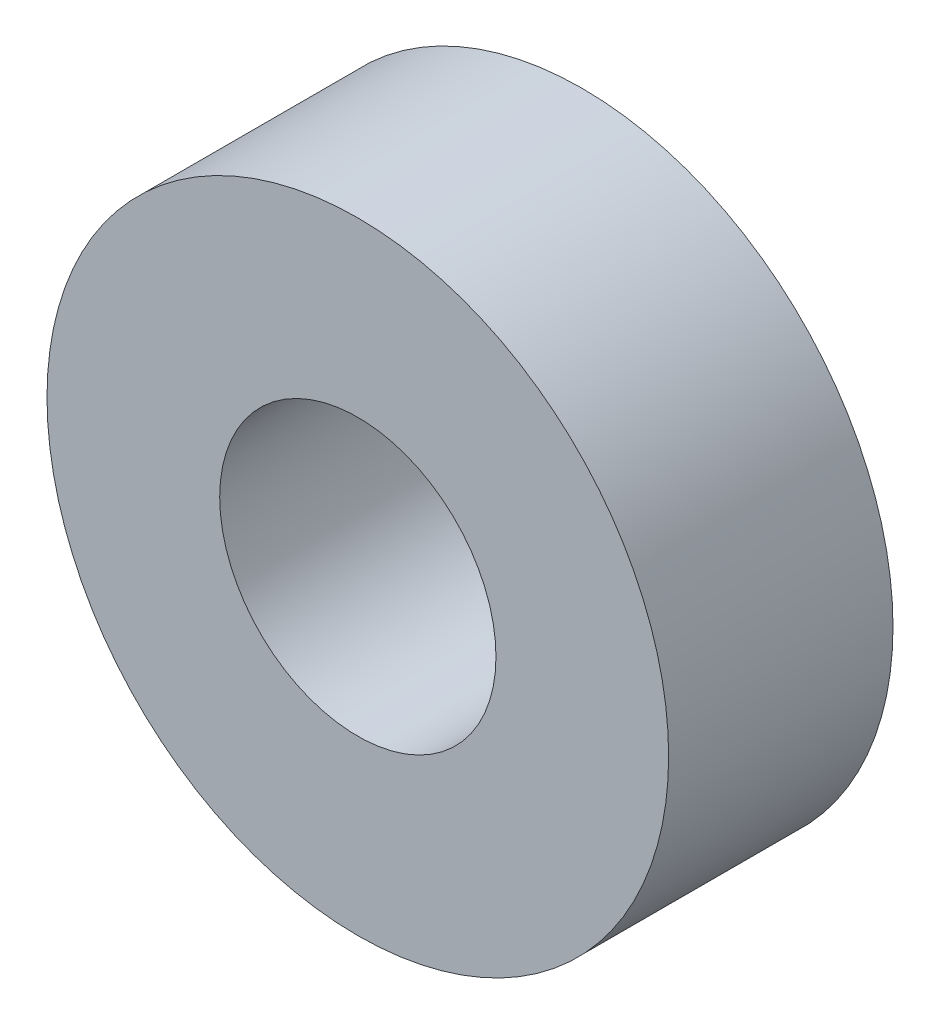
ISO-10303-21;
HEADER;
FILE_DESCRIPTION(('STEP AP214'),'2;1');
FILE_NAME('part.step','',(''),(''),'','','');
FILE_SCHEMA(('AUTOMOTIVE_DESIGN { 1 0 10303 214 1 1 1 1 }'));
ENDSEC;
DATA;
#1=APPLICATION_CONTEXT('core data for automotive mechanical design processes');
#2=APPLICATION_PROTOCOL_DEFINITION('international standard','automotive_design',2000,#1);
#3=PRODUCT_CONTEXT('',#1,'mechanical');
#4=PRODUCT('Part','Part','',(#3));
#5=PRODUCT_RELATED_PRODUCT_CATEGORY('part','',(#4));
#6=PRODUCT_DEFINITION_FORMATION('','',#4);
#7=PRODUCT_DEFINITION_CONTEXT('part definition',#1,'design');
#8=PRODUCT_DEFINITION('design','',#6,#7);
#9=PRODUCT_DEFINITION_SHAPE('','',#8);
#10=(LENGTH_UNIT() NAMED_UNIT(*) SI_UNIT(.MILLI.,.METRE.));
#11=(NAMED_UNIT(*) PLANE_ANGLE_UNIT() SI_UNIT($,.RADIAN.));
#12=(NAMED_UNIT(*) SI_UNIT($,.STERADIAN.) SOLID_ANGLE_UNIT());
#13=UNCERTAINTY_MEASURE_WITH_UNIT(LENGTH_MEASURE(1.E-05),#10,'distance_accuracy_value','');
#14=(GEOMETRIC_REPRESENTATION_CONTEXT(3) GLOBAL_UNCERTAINTY_ASSIGNED_CONTEXT((#13)) GLOBAL_UNIT_ASSIGNED_CONTEXT((#10,
#11,#12)) REPRESENTATION_CONTEXT('',''));
#15=CARTESIAN_POINT('',(0.,0.,0.));
#16=DIRECTION('',(0.,0.,1.));
#17=DIRECTION('',(1.,0.,0.));
#18=AXIS2_PLACEMENT_3D('',#15,#16,#17);
#19=CARTESIAN_POINT('',(0.,0.,10.3124));
#20=DIRECTION('',(0.,0.,1.));
#21=DIRECTION('',(1.,0.,0.));
#22=AXIS2_PLACEMENT_3D('',#19,#20,#21);
#23=PLANE('',#22);
#24=CARTESIAN_POINT('',(0.,0.,10.3124));
#25=DIRECTION('',(0.,0.,1.));
#26=DIRECTION('',(1.,0.,0.));
#27=AXIS2_PLACEMENT_3D('',#24,#25,#26);
#28=CIRCLE('',#27,14.2875);
#29=CARTESIAN_POINT('',(14.2875,0.,10.3124));
#30=VERTEX_POINT('',#29);
#31=EDGE_CURVE('E10',#30,#30,#28,.T.);
#32=ORIENTED_EDGE('',*,*,#31,.T.);
#33=EDGE_LOOP('',(#32));
#34=FACE_BOUND('',#33,.T.);
#35=CARTESIAN_POINT('',(0.,0.,10.3124));
#36=DIRECTION('',(0.,0.,1.));
#37=DIRECTION('',(1.,0.,0.));
#38=AXIS2_PLACEMENT_3D('',#35,#36,#37);
#39=CIRCLE('',#38,6.35);
#40=CARTESIAN_POINT('',(6.35,0.,10.3124));
#41=VERTEX_POINT('',#40);
#42=EDGE_CURVE('E41',#41,#41,#39,.T.);
#43=ORIENTED_EDGE('',*,*,#42,.F.);
#44=EDGE_LOOP('',(#43));
#45=FACE_BOUND('',#44,.T.);
#46=ADVANCED_FACE('F30',(#34,#45),#23,.T.);
#47=CARTESIAN_POINT('',(0.,0.,0.));
#48=DIRECTION('',(0.,0.,1.));
#49=DIRECTION('',(1.,0.,0.));
#50=AXIS2_PLACEMENT_3D('',#47,#48,#49);
#51=PLANE('',#50);
#52=CARTESIAN_POINT('',(0.,0.,0.));
#53=DIRECTION('',(0.,0.,1.));
#54=DIRECTION('',(1.,0.,0.));
#55=AXIS2_PLACEMENT_3D('',#52,#53,#54);
#56=CIRCLE('',#55,14.2875);
#57=CARTESIAN_POINT('',(14.2875,0.,0.));
#58=VERTEX_POINT('',#57);
#59=EDGE_CURVE('E34',#58,#58,#56,.T.);
#60=ORIENTED_EDGE('',*,*,#59,.F.);
#61=EDGE_LOOP('',(#60));
#62=FACE_BOUND('',#61,.T.);
#63=CARTESIAN_POINT('',(0.,0.,0.));
#64=DIRECTION('',(0.,0.,1.));
#65=DIRECTION('',(1.,0.,0.));
#66=AXIS2_PLACEMENT_3D('',#63,#64,#65);
#67=CIRCLE('',#66,6.35);
#68=CARTESIAN_POINT('',(6.35,0.,0.));
#69=VERTEX_POINT('',#68);
#70=EDGE_CURVE('E43',#69,#69,#67,.T.);
#71=ORIENTED_EDGE('',*,*,#70,.T.);
#72=EDGE_LOOP('',(#71));
#73=FACE_BOUND('',#72,.T.);
#74=ADVANCED_FACE('F53',(#62,#73),#51,.F.);
#75=CARTESIAN_POINT('',(0.,0.,10.3124));
#76=DIRECTION('',(0.,0.,-1.));
#77=DIRECTION('',(-1.,0.,0.));
#78=AXIS2_PLACEMENT_3D('',#75,#76,#77);
#79=CYLINDRICAL_SURFACE('',#78,14.2875);
#80=ORIENTED_EDGE('',*,*,#31,.F.);
#81=EDGE_LOOP('',(#80));
#82=FACE_BOUND('',#81,.T.);
#83=ORIENTED_EDGE('',*,*,#59,.T.);
#84=EDGE_LOOP('',(#83));
#85=FACE_BOUND('',#84,.T.);
#86=ADVANCED_FACE('F32',(#82,#85),#79,.T.);
#87=CARTESIAN_POINT('',(0.,0.,10.3124));
#88=DIRECTION('',(0.,0.,-1.));
#89=DIRECTION('',(-1.,0.,0.));
#90=AXIS2_PLACEMENT_3D('',#87,#88,#89);
#91=CYLINDRICAL_SURFACE('',#90,6.35);
#92=ORIENTED_EDGE('',*,*,#42,.T.);
#93=EDGE_LOOP('',(#92));
#94=FACE_BOUND('',#93,.T.);
#95=ORIENTED_EDGE('',*,*,#70,.F.);
#96=EDGE_LOOP('',(#95));
#97=FACE_BOUND('',#96,.T.);
#98=ADVANCED_FACE('F49',(#94,#97),#91,.F.);
#99=CLOSED_SHELL('',(#46,#74,#86,#98));
#100=MANIFOLD_SOLID_BREP('B2',#99);
#101=ADVANCED_BREP_SHAPE_REPRESENTATION('',(#18,#100),#14);
#102=SHAPE_DEFINITION_REPRESENTATION(#9,#101);
ENDSEC;
END-ISO-10303-21;
